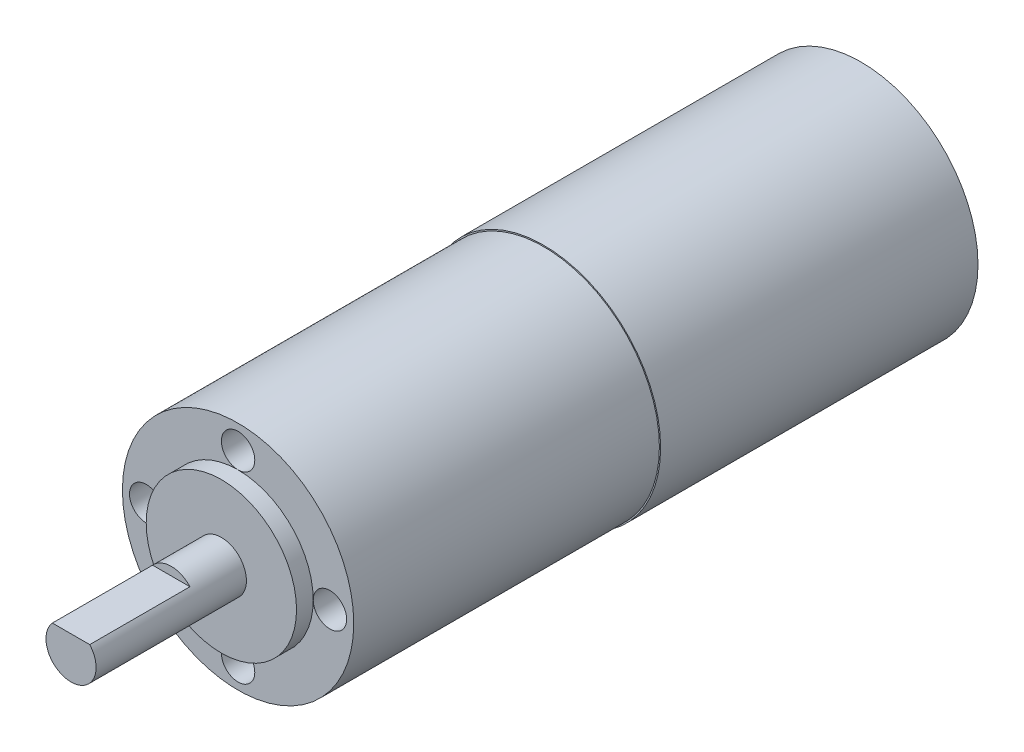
ISO-10303-21;
HEADER;
FILE_DESCRIPTION(('STEP AP214'),'2;1');
FILE_NAME('part.step','',(''),(''),'','','');
FILE_SCHEMA(('AUTOMOTIVE_DESIGN { 1 0 10303 214 1 1 1 1 }'));
ENDSEC;
DATA;
#1=APPLICATION_CONTEXT('core data for automotive mechanical design processes');
#2=APPLICATION_PROTOCOL_DEFINITION('international standard','automotive_design',2000,#1);
#3=PRODUCT_CONTEXT('',#1,'mechanical');
#4=PRODUCT('Part','Part','',(#3));
#5=PRODUCT_RELATED_PRODUCT_CATEGORY('part','',(#4));
#6=PRODUCT_DEFINITION_FORMATION('','',#4);
#7=PRODUCT_DEFINITION_CONTEXT('part definition',#1,'design');
#8=PRODUCT_DEFINITION('design','',#6,#7);
#9=PRODUCT_DEFINITION_SHAPE('','',#8);
#10=(LENGTH_UNIT() NAMED_UNIT(*) SI_UNIT(.MILLI.,.METRE.));
#11=(NAMED_UNIT(*) PLANE_ANGLE_UNIT() SI_UNIT($,.RADIAN.));
#12=(NAMED_UNIT(*) SI_UNIT($,.STERADIAN.) SOLID_ANGLE_UNIT());
#13=UNCERTAINTY_MEASURE_WITH_UNIT(LENGTH_MEASURE(1.E-05),#10,'distance_accuracy_value','');
#14=(GEOMETRIC_REPRESENTATION_CONTEXT(3) GLOBAL_UNCERTAINTY_ASSIGNED_CONTEXT((#13)) GLOBAL_UNIT_ASSIGNED_CONTEXT((#10,
#11,#12)) REPRESENTATION_CONTEXT('',''));
#15=CARTESIAN_POINT('',(0.,0.,0.));
#16=DIRECTION('',(0.,0.,1.));
#17=DIRECTION('',(1.,0.,0.));
#18=AXIS2_PLACEMENT_3D('',#15,#16,#17);
#19=CARTESIAN_POINT('',(0.,0.,38.));
#20=DIRECTION('',(0.,0.,-1.));
#21=DIRECTION('',(-1.,0.,0.));
#22=AXIS2_PLACEMENT_3D('',#19,#20,#21);
#23=CYLINDRICAL_SURFACE('',#22,14.);
#24=CARTESIAN_POINT('',(0.,0.,38.));
#25=DIRECTION('',(0.,0.,1.));
#26=DIRECTION('',(1.,0.,0.));
#27=AXIS2_PLACEMENT_3D('',#24,#25,#26);
#28=CIRCLE('',#27,14.);
#29=CARTESIAN_POINT('',(14.,0.,38.));
#30=VERTEX_POINT('',#29);
#31=EDGE_CURVE('E134',#30,#30,#28,.T.);
#32=ORIENTED_EDGE('',*,*,#31,.F.);
#33=EDGE_LOOP('',(#32));
#34=FACE_BOUND('',#33,.T.);
#35=CARTESIAN_POINT('',(0.,0.,0.));
#36=DIRECTION('',(0.,0.,1.));
#37=DIRECTION('',(1.,0.,0.));
#38=AXIS2_PLACEMENT_3D('',#35,#36,#37);
#39=CIRCLE('',#38,14.);
#40=CARTESIAN_POINT('',(14.,0.,0.));
#41=VERTEX_POINT('',#40);
#42=EDGE_CURVE('E129',#41,#41,#39,.T.);
#43=ORIENTED_EDGE('',*,*,#42,.T.);
#44=EDGE_LOOP('',(#43));
#45=FACE_BOUND('',#44,.T.);
#46=ADVANCED_FACE('F47',(#34,#45),#23,.T.);
#47=CARTESIAN_POINT('',(0.,0.,38.));
#48=DIRECTION('',(0.,0.,1.));
#49=DIRECTION('',(1.,0.,0.));
#50=AXIS2_PLACEMENT_3D('',#47,#48,#49);
#51=PLANE('',#50);
#52=CARTESIAN_POINT('',(0.,0.,38.));
#53=DIRECTION('',(0.,0.,1.));
#54=DIRECTION('',(1.,0.,0.));
#55=AXIS2_PLACEMENT_3D('',#52,#53,#54);
#56=CIRCLE('',#55,13.85);
#57=CARTESIAN_POINT('',(13.85,0.,38.));
#58=VERTEX_POINT('',#57);
#59=EDGE_CURVE('E130',#58,#58,#56,.T.);
#60=ORIENTED_EDGE('',*,*,#59,.F.);
#61=EDGE_LOOP('',(#60));
#62=FACE_BOUND('',#61,.T.);
#63=ORIENTED_EDGE('',*,*,#31,.T.);
#64=EDGE_LOOP('',(#63));
#65=FACE_BOUND('',#64,.T.);
#66=ADVANCED_FACE('F154',(#62,#65),#51,.T.);
#67=CARTESIAN_POINT('',(0.,0.,0.));
#68=DIRECTION('',(0.,0.,1.));
#69=DIRECTION('',(1.,0.,0.));
#70=AXIS2_PLACEMENT_3D('',#67,#68,#69);
#71=PLANE('',#70);
#72=ORIENTED_EDGE('',*,*,#42,.F.);
#73=EDGE_LOOP('',(#72));
#74=FACE_BOUND('',#73,.T.);
#75=ADVANCED_FACE('F160',(#74),#71,.F.);
#76=CARTESIAN_POINT('',(0.,0.,74.6));
#77=DIRECTION('',(0.,0.,-1.));
#78=DIRECTION('',(-1.,0.,0.));
#79=AXIS2_PLACEMENT_3D('',#76,#77,#78);
#80=CYLINDRICAL_SURFACE('',#79,13.85);
#81=CARTESIAN_POINT('',(0.,0.,74.6));
#82=DIRECTION('',(0.,0.,1.));
#83=DIRECTION('',(1.,0.,0.));
#84=AXIS2_PLACEMENT_3D('',#81,#82,#83);
#85=CIRCLE('',#84,13.85);
#86=CARTESIAN_POINT('',(13.85,0.,74.6));
#87=VERTEX_POINT('',#86);
#88=EDGE_CURVE('E120',#87,#87,#85,.T.);
#89=ORIENTED_EDGE('',*,*,#88,.F.);
#90=EDGE_LOOP('',(#89));
#91=FACE_BOUND('',#90,.T.);
#92=ORIENTED_EDGE('',*,*,#59,.T.);
#93=EDGE_LOOP('',(#92));
#94=FACE_BOUND('',#93,.T.);
#95=ADVANCED_FACE('F167',(#91,#94),#80,.T.);
#96=CARTESIAN_POINT('',(0.,0.,74.6));
#97=DIRECTION('',(0.,0.,1.));
#98=DIRECTION('',(1.,0.,0.));
#99=AXIS2_PLACEMENT_3D('',#96,#97,#98);
#100=PLANE('',#99);
#101=CARTESIAN_POINT('',(0.,0.,74.6));
#102=DIRECTION('',(0.,0.,1.));
#103=DIRECTION('',(1.,0.,0.));
#104=AXIS2_PLACEMENT_3D('',#101,#102,#103);
#105=CIRCLE('',#104,9.);
#106=CARTESIAN_POINT('',(0.,9.,74.6));
#107=VERTEX_POINT('',#106);
#108=CARTESIAN_POINT('',(-9.,0.,74.6));
#109=VERTEX_POINT('',#108);
#110=EDGE_CURVE('E124',#107,#109,#105,.T.);
#111=ORIENTED_EDGE('',*,*,#110,.F.);
#112=CARTESIAN_POINT('',(0.,11.,74.6));
#113=DIRECTION('',(0.,0.,1.));
#114=DIRECTION('',(1.,0.,0.));
#115=AXIS2_PLACEMENT_3D('',#112,#113,#114);
#116=CIRCLE('',#115,2.);
#117=EDGE_CURVE('E97',#107,#107,#116,.F.);
#118=ORIENTED_EDGE('',*,*,#117,.T.);
#119=CARTESIAN_POINT('',(9.,0.,74.6));
#120=VERTEX_POINT('',#119);
#121=EDGE_CURVE('E116',#120,#107,#105,.T.);
#122=ORIENTED_EDGE('',*,*,#121,.F.);
#123=CARTESIAN_POINT('',(11.,0.,74.6));
#124=DIRECTION('',(0.,0.,1.));
#125=DIRECTION('',(1.,0.,0.));
#126=AXIS2_PLACEMENT_3D('',#123,#124,#125);
#127=CIRCLE('',#126,2.);
#128=EDGE_CURVE('E350',#120,#120,#127,.F.);
#129=ORIENTED_EDGE('',*,*,#128,.T.);
#130=CARTESIAN_POINT('',(0.,-9.,74.6));
#131=VERTEX_POINT('',#130);
#132=EDGE_CURVE('E125',#131,#120,#105,.T.);
#133=ORIENTED_EDGE('',*,*,#132,.F.);
#134=CARTESIAN_POINT('',(0.,-11.,74.6));
#135=DIRECTION('',(0.,0.,1.));
#136=DIRECTION('',(1.,0.,0.));
#137=AXIS2_PLACEMENT_3D('',#134,#135,#136);
#138=CIRCLE('',#137,2.);
#139=EDGE_CURVE('E60',#131,#131,#138,.F.);
#140=ORIENTED_EDGE('',*,*,#139,.T.);
#141=EDGE_CURVE('E363',#109,#131,#105,.T.);
#142=ORIENTED_EDGE('',*,*,#141,.F.);
#143=CARTESIAN_POINT('',(-11.,0.,74.6));
#144=DIRECTION('',(0.,0.,1.));
#145=DIRECTION('',(1.,0.,0.));
#146=AXIS2_PLACEMENT_3D('',#143,#144,#145);
#147=CIRCLE('',#146,2.);
#148=EDGE_CURVE('E65',#109,#109,#147,.F.);
#149=ORIENTED_EDGE('',*,*,#148,.T.);
#150=EDGE_LOOP('',(#111,#118,#122,#129,#133,#140,#142,#149));
#151=FACE_BOUND('',#150,.T.);
#152=ORIENTED_EDGE('',*,*,#88,.T.);
#153=EDGE_LOOP('',(#152));
#154=FACE_BOUND('',#153,.T.);
#155=ADVANCED_FACE('F171',(#151,#154),#100,.T.);
#156=CARTESIAN_POINT('',(0.,0.,76.6));
#157=DIRECTION('',(0.,0.,-1.));
#158=DIRECTION('',(-1.,0.,0.));
#159=AXIS2_PLACEMENT_3D('',#156,#157,#158);
#160=CYLINDRICAL_SURFACE('',#159,9.);
#161=ORIENTED_EDGE('',*,*,#121,.T.);
#162=ORIENTED_EDGE('',*,*,#110,.T.);
#163=ORIENTED_EDGE('',*,*,#141,.T.);
#164=ORIENTED_EDGE('',*,*,#132,.T.);
#165=EDGE_LOOP('',(#161,#162,#163,#164));
#166=FACE_BOUND('',#165,.T.);
#167=CARTESIAN_POINT('',(0.,0.,76.6));
#168=DIRECTION('',(0.,0.,1.));
#169=DIRECTION('',(1.,0.,0.));
#170=AXIS2_PLACEMENT_3D('',#167,#168,#169);
#171=CIRCLE('',#170,9.);
#172=CARTESIAN_POINT('',(9.,0.,76.6));
#173=VERTEX_POINT('',#172);
#174=EDGE_CURVE('E108',#173,#173,#171,.T.);
#175=ORIENTED_EDGE('',*,*,#174,.F.);
#176=EDGE_LOOP('',(#175));
#177=FACE_BOUND('',#176,.T.);
#178=ADVANCED_FACE('F177',(#166,#177),#160,.T.);
#179=CARTESIAN_POINT('',(0.,0.,76.6));
#180=DIRECTION('',(0.,0.,1.));
#181=DIRECTION('',(1.,0.,0.));
#182=AXIS2_PLACEMENT_3D('',#179,#180,#181);
#183=PLANE('',#182);
#184=CARTESIAN_POINT('',(0.,0.,76.6));
#185=DIRECTION('',(0.,0.,1.));
#186=DIRECTION('',(1.,0.,0.));
#187=AXIS2_PLACEMENT_3D('',#184,#185,#186);
#188=CIRCLE('',#187,3.);
#189=CARTESIAN_POINT('',(3.,0.,76.6));
#190=VERTEX_POINT('',#189);
#191=EDGE_CURVE('E112',#190,#190,#188,.T.);
#192=ORIENTED_EDGE('',*,*,#191,.F.);
#193=EDGE_LOOP('',(#192));
#194=FACE_BOUND('',#193,.T.);
#195=ORIENTED_EDGE('',*,*,#174,.T.);
#196=EDGE_LOOP('',(#195));
#197=FACE_BOUND('',#196,.T.);
#198=ADVANCED_FACE('F150',(#194,#197),#183,.T.);
#199=CARTESIAN_POINT('',(0.,0.,94.6));
#200=DIRECTION('',(0.,0.,-1.));
#201=DIRECTION('',(-1.,0.,0.));
#202=AXIS2_PLACEMENT_3D('',#199,#200,#201);
#203=CYLINDRICAL_SURFACE('',#202,3.);
#204=CARTESIAN_POINT('',(0.,0.,94.6));
#205=DIRECTION('',(0.,0.,1.));
#206=DIRECTION('',(1.,0.,0.));
#207=AXIS2_PLACEMENT_3D('',#204,#205,#206);
#208=CIRCLE('',#207,3.);
#209=CARTESIAN_POINT('',(-2.23606797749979,2.,94.6));
#210=VERTEX_POINT('',#209);
#211=CARTESIAN_POINT('',(2.23606797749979,2.,94.6));
#212=VERTEX_POINT('',#211);
#213=EDGE_CURVE('E103',#210,#212,#208,.T.);
#214=ORIENTED_EDGE('',*,*,#213,.F.);
#215=DIRECTION('',(0.,0.,-1.));
#216=VECTOR('',#215,1.);
#217=CARTESIAN_POINT('',(-2.23606797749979,2.,94.6));
#218=LINE('',#217,#216);
#219=CARTESIAN_POINT('',(-2.23606797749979,2.,82.6));
#220=VERTEX_POINT('',#219);
#221=EDGE_CURVE('E93',#210,#220,#218,.T.);
#222=ORIENTED_EDGE('',*,*,#221,.T.);
#223=CARTESIAN_POINT('',(0.,0.,82.6));
#224=DIRECTION('',(0.,0.,-1.));
#225=DIRECTION('',(-1.,0.,0.));
#226=AXIS2_PLACEMENT_3D('',#223,#224,#225);
#227=CIRCLE('',#226,3.);
#228=CARTESIAN_POINT('',(2.23606797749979,2.,82.6));
#229=VERTEX_POINT('',#228);
#230=EDGE_CURVE('E11',#220,#229,#227,.T.);
#231=ORIENTED_EDGE('',*,*,#230,.T.);
#232=DIRECTION('',(0.,0.,-1.));
#233=VECTOR('',#232,1.);
#234=CARTESIAN_POINT('',(2.23606797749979,2.,94.6));
#235=LINE('',#234,#233);
#236=EDGE_CURVE('E95',#229,#212,#235,.F.);
#237=ORIENTED_EDGE('',*,*,#236,.T.);
#238=EDGE_LOOP('',(#214,#222,#231,#237));
#239=FACE_BOUND('',#238,.T.);
#240=ORIENTED_EDGE('',*,*,#191,.T.);
#241=EDGE_LOOP('',(#240));
#242=FACE_BOUND('',#241,.T.);
#243=ADVANCED_FACE('F100',(#239,#242),#203,.T.);
#244=CARTESIAN_POINT('',(0.,0.,94.6));
#245=DIRECTION('',(0.,0.,1.));
#246=DIRECTION('',(1.,0.,0.));
#247=AXIS2_PLACEMENT_3D('',#244,#245,#246);
#248=PLANE('',#247);
#249=DIRECTION('',(1.,0.,0.));
#250=VECTOR('',#249,1.);
#251=CARTESIAN_POINT('',(0.,2.,94.6));
#252=LINE('',#251,#250);
#253=EDGE_CURVE('E55',#210,#212,#252,.T.);
#254=ORIENTED_EDGE('',*,*,#253,.F.);
#255=ORIENTED_EDGE('',*,*,#213,.T.);
#256=EDGE_LOOP('',(#254,#255));
#257=FACE_BOUND('',#256,.T.);
#258=ADVANCED_FACE('F142',(#257),#248,.T.);
#259=CARTESIAN_POINT('',(-14.,3.,82.6));
#260=DIRECTION('',(0.,0.,-1.));
#261=DIRECTION('',(-1.,0.,0.));
#262=AXIS2_PLACEMENT_3D('',#259,#260,#261);
#263=PLANE('',#262);
#264=DIRECTION('',(1.,0.,0.));
#265=VECTOR('',#264,1.);
#266=CARTESIAN_POINT('',(-14.,2.,82.6));
#267=LINE('',#266,#265);
#268=EDGE_CURVE('E87',#220,#229,#267,.T.);
#269=ORIENTED_EDGE('',*,*,#268,.T.);
#270=ORIENTED_EDGE('',*,*,#230,.F.);
#271=EDGE_LOOP('',(#269,#270));
#272=FACE_BOUND('',#271,.T.);
#273=ADVANCED_FACE('F86',(#272),#263,.F.);
#274=CARTESIAN_POINT('',(-14.,2.,94.6));
#275=DIRECTION('',(0.,-1.,0.));
#276=DIRECTION('',(0.,0.,-1.));
#277=AXIS2_PLACEMENT_3D('',#274,#275,#276);
#278=PLANE('',#277);
#279=ORIENTED_EDGE('',*,*,#253,.T.);
#280=ORIENTED_EDGE('',*,*,#236,.F.);
#281=ORIENTED_EDGE('',*,*,#268,.F.);
#282=ORIENTED_EDGE('',*,*,#221,.F.);
#283=EDGE_LOOP('',(#279,#280,#281,#282));
#284=FACE_BOUND('',#283,.T.);
#285=ADVANCED_FACE('F92',(#284),#278,.F.);
#286=CARTESIAN_POINT('',(-11.,0.,94.6));
#287=DIRECTION('',(0.,0.,-1.));
#288=DIRECTION('',(-1.,0.,0.));
#289=AXIS2_PLACEMENT_3D('',#286,#287,#288);
#290=CYLINDRICAL_SURFACE('',#289,2.);
#291=ORIENTED_EDGE('',*,*,#148,.F.);
#292=EDGE_LOOP('',(#291));
#293=FACE_BOUND('',#292,.T.);
#294=CARTESIAN_POINT('',(-11.,0.,56.6));
#295=DIRECTION('',(0.,0.,1.));
#296=DIRECTION('',(1.,0.,0.));
#297=AXIS2_PLACEMENT_3D('',#294,#295,#296);
#298=CIRCLE('',#297,2.);
#299=CARTESIAN_POINT('',(-9.,0.,56.6));
#300=VERTEX_POINT('',#299);
#301=EDGE_CURVE('E344',#300,#300,#298,.T.);
#302=ORIENTED_EDGE('',*,*,#301,.F.);
#303=EDGE_LOOP('',(#302));
#304=FACE_BOUND('',#303,.T.);
#305=ADVANCED_FACE('F197',(#293,#304),#290,.F.);
#306=CARTESIAN_POINT('',(-11.,0.,56.6));
#307=DIRECTION('',(0.,0.,1.));
#308=DIRECTION('',(1.,0.,0.));
#309=AXIS2_PLACEMENT_3D('',#306,#307,#308);
#310=PLANE('',#309);
#311=ORIENTED_EDGE('',*,*,#301,.T.);
#312=EDGE_LOOP('',(#311));
#313=FACE_BOUND('',#312,.T.);
#314=ADVANCED_FACE('F201',(#313),#310,.T.);
#315=CARTESIAN_POINT('',(0.,-11.,94.6));
#316=DIRECTION('',(0.,0.,-1.));
#317=DIRECTION('',(-1.,0.,0.));
#318=AXIS2_PLACEMENT_3D('',#315,#316,#317);
#319=CYLINDRICAL_SURFACE('',#318,2.);
#320=ORIENTED_EDGE('',*,*,#139,.F.);
#321=EDGE_LOOP('',(#320));
#322=FACE_BOUND('',#321,.T.);
#323=CARTESIAN_POINT('',(0.,-11.,56.6));
#324=DIRECTION('',(0.,0.,1.));
#325=DIRECTION('',(1.,0.,0.));
#326=AXIS2_PLACEMENT_3D('',#323,#324,#325);
#327=CIRCLE('',#326,2.);
#328=CARTESIAN_POINT('',(2.,-11.,56.6));
#329=VERTEX_POINT('',#328);
#330=EDGE_CURVE('E338',#329,#329,#327,.T.);
#331=ORIENTED_EDGE('',*,*,#330,.F.);
#332=EDGE_LOOP('',(#331));
#333=FACE_BOUND('',#332,.T.);
#334=ADVANCED_FACE('F210',(#322,#333),#319,.F.);
#335=CARTESIAN_POINT('',(0.,-11.,56.6));
#336=DIRECTION('',(0.,0.,1.));
#337=DIRECTION('',(1.,0.,0.));
#338=AXIS2_PLACEMENT_3D('',#335,#336,#337);
#339=PLANE('',#338);
#340=ORIENTED_EDGE('',*,*,#330,.T.);
#341=EDGE_LOOP('',(#340));
#342=FACE_BOUND('',#341,.T.);
#343=ADVANCED_FACE('F219',(#342),#339,.T.);
#344=CARTESIAN_POINT('',(11.,0.,94.6));
#345=DIRECTION('',(0.,0.,-1.));
#346=DIRECTION('',(-1.,0.,0.));
#347=AXIS2_PLACEMENT_3D('',#344,#345,#346);
#348=CYLINDRICAL_SURFACE('',#347,2.);
#349=ORIENTED_EDGE('',*,*,#128,.F.);
#350=EDGE_LOOP('',(#349));
#351=FACE_BOUND('',#350,.T.);
#352=CARTESIAN_POINT('',(11.,0.,56.6));
#353=DIRECTION('',(0.,0.,1.));
#354=DIRECTION('',(1.,0.,0.));
#355=AXIS2_PLACEMENT_3D('',#352,#353,#354);
#356=CIRCLE('',#355,2.);
#357=CARTESIAN_POINT('',(13.,0.,56.6));
#358=VERTEX_POINT('',#357);
#359=EDGE_CURVE('E332',#358,#358,#356,.T.);
#360=ORIENTED_EDGE('',*,*,#359,.F.);
#361=EDGE_LOOP('',(#360));
#362=FACE_BOUND('',#361,.T.);
#363=ADVANCED_FACE('F227',(#351,#362),#348,.F.);
#364=CARTESIAN_POINT('',(11.,0.,56.6));
#365=DIRECTION('',(0.,0.,1.));
#366=DIRECTION('',(1.,0.,0.));
#367=AXIS2_PLACEMENT_3D('',#364,#365,#366);
#368=PLANE('',#367);
#369=ORIENTED_EDGE('',*,*,#359,.T.);
#370=EDGE_LOOP('',(#369));
#371=FACE_BOUND('',#370,.T.);
#372=ADVANCED_FACE('F236',(#371),#368,.T.);
#373=CARTESIAN_POINT('',(0.,11.,94.6));
#374=DIRECTION('',(0.,0.,-1.));
#375=DIRECTION('',(-1.,0.,0.));
#376=AXIS2_PLACEMENT_3D('',#373,#374,#375);
#377=CYLINDRICAL_SURFACE('',#376,2.);
#378=ORIENTED_EDGE('',*,*,#117,.F.);
#379=EDGE_LOOP('',(#378));
#380=FACE_BOUND('',#379,.T.);
#381=CARTESIAN_POINT('',(0.,11.,56.6));
#382=DIRECTION('',(0.,0.,1.));
#383=DIRECTION('',(1.,0.,0.));
#384=AXIS2_PLACEMENT_3D('',#381,#382,#383);
#385=CIRCLE('',#384,2.);
#386=CARTESIAN_POINT('',(2.,11.,56.6));
#387=VERTEX_POINT('',#386);
#388=EDGE_CURVE('E329',#387,#387,#385,.T.);
#389=ORIENTED_EDGE('',*,*,#388,.F.);
#390=EDGE_LOOP('',(#389));
#391=FACE_BOUND('',#390,.T.);
#392=ADVANCED_FACE('F245',(#380,#391),#377,.F.);
#393=CARTESIAN_POINT('',(0.,11.,56.6));
#394=DIRECTION('',(0.,0.,1.));
#395=DIRECTION('',(1.,0.,0.));
#396=AXIS2_PLACEMENT_3D('',#393,#394,#395);
#397=PLANE('',#396);
#398=ORIENTED_EDGE('',*,*,#388,.T.);
#399=EDGE_LOOP('',(#398));
#400=FACE_BOUND('',#399,.T.);
#401=ADVANCED_FACE('F254',(#400),#397,.T.);
#402=CLOSED_SHELL('',(#46,#66,#75,#95,#155,#178,#198,#243,#258,#273,#285,#305,#314,#334,#343,
#363,#372,#392,#401));
#403=MANIFOLD_SOLID_BREP('B2',#402);
#404=ADVANCED_BREP_SHAPE_REPRESENTATION('',(#18,#403),#14);
#405=SHAPE_DEFINITION_REPRESENTATION(#9,#404);
ENDSEC;
END-ISO-10303-21;
